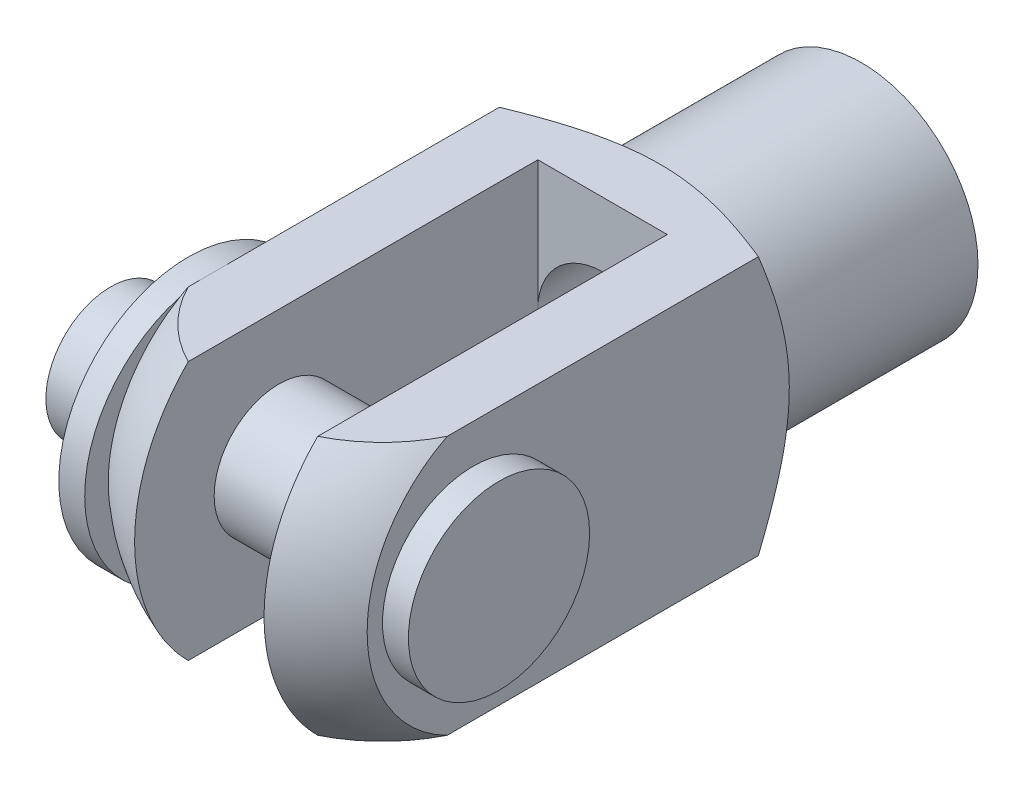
ISO-10303-21;
HEADER;
FILE_DESCRIPTION(('STEP AP214'),'2;1');
FILE_NAME('part.step','',(''),(''),'','','');
FILE_SCHEMA(('AUTOMOTIVE_DESIGN { 1 0 10303 214 1 1 1 1 }'));
ENDSEC;
DATA;
#1=APPLICATION_CONTEXT('core data for automotive mechanical design processes');
#2=APPLICATION_PROTOCOL_DEFINITION('international standard','automotive_design',2000,#1);
#3=PRODUCT_CONTEXT('',#1,'mechanical');
#4=PRODUCT('Part','Part','',(#3));
#5=PRODUCT_RELATED_PRODUCT_CATEGORY('part','',(#4));
#6=PRODUCT_DEFINITION_FORMATION('','',#4);
#7=PRODUCT_DEFINITION_CONTEXT('part definition',#1,'design');
#8=PRODUCT_DEFINITION('design','',#6,#7);
#9=PRODUCT_DEFINITION_SHAPE('','',#8);
#10=(LENGTH_UNIT() NAMED_UNIT(*) SI_UNIT(.MILLI.,.METRE.));
#11=(NAMED_UNIT(*) PLANE_ANGLE_UNIT() SI_UNIT($,.RADIAN.));
#12=(NAMED_UNIT(*) SI_UNIT($,.STERADIAN.) SOLID_ANGLE_UNIT());
#13=UNCERTAINTY_MEASURE_WITH_UNIT(LENGTH_MEASURE(1.E-05),#10,'distance_accuracy_value','');
#14=(GEOMETRIC_REPRESENTATION_CONTEXT(3) GLOBAL_UNCERTAINTY_ASSIGNED_CONTEXT((#13)) GLOBAL_UNIT_ASSIGNED_CONTEXT((#10,
#11,#12)) REPRESENTATION_CONTEXT('',''));
#15=CARTESIAN_POINT('',(0.,0.,0.));
#16=DIRECTION('',(0.,0.,1.));
#17=DIRECTION('',(1.,0.,0.));
#18=AXIS2_PLACEMENT_3D('',#15,#16,#17);
#19=CARTESIAN_POINT('',(-10.,-19.,53.));
#20=DIRECTION('',(1.,0.,0.));
#21=DIRECTION('',(0.,0.,-1.));
#22=AXIS2_PLACEMENT_3D('',#19,#20,#21);
#23=PLANE('',#22);
#24=DIRECTION('',(0.,0.,1.));
#25=VECTOR('',#24,1.);
#26=CARTESIAN_POINT('',(-10.,10.,53.));
#27=LINE('',#26,#25);
#28=CARTESIAN_POINT('',(-10.,10.,40.));
#29=VERTEX_POINT('',#28);
#30=CARTESIAN_POINT('',(-10.,10.,42.));
#31=VERTEX_POINT('',#30);
#32=EDGE_CURVE('E132',#29,#31,#27,.T.);
#33=ORIENTED_EDGE('',*,*,#32,.F.);
#34=CARTESIAN_POINT('',(-10.,0.,40.));
#35=DIRECTION('',(1.,0.,0.));
#36=DIRECTION('',(0.,0.,-1.));
#37=AXIS2_PLACEMENT_3D('',#34,#35,#36);
#38=CIRCLE('',#37,10.);
#39=CARTESIAN_POINT('',(-10.,9.637888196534,42.6666666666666));
#40=VERTEX_POINT('',#39);
#41=EDGE_CURVE('E46',#29,#40,#38,.T.);
#42=ORIENTED_EDGE('',*,*,#41,.T.);
#43=CARTESIAN_POINT('',(-10.,-7.25114412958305E-13,36.9999999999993));
#44=DIRECTION('',(1.,0.,0.));
#45=DIRECTION('',(0.,0.,-1.));
#46=AXIS2_PLACEMENT_3D('',#43,#44,#45);
#47=CIRCLE('',#46,11.1803398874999);
#48=EDGE_CURVE('E123',#40,#31,#47,.F.);
#49=ORIENTED_EDGE('',*,*,#48,.T.);
#50=EDGE_LOOP('',(#33,#42,#49));
#51=FACE_BOUND('',#50,.T.);
#52=ADVANCED_FACE('F31',(#51),#23,.F.);
#53=CARTESIAN_POINT('',(-10.,-10.,42.0000000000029));
#54=VERTEX_POINT('',#53);
#55=CARTESIAN_POINT('',(-10.,-9.63788819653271,42.6666666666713));
#56=VERTEX_POINT('',#55);
#57=EDGE_CURVE('E122',#54,#56,#47,.F.);
#58=ORIENTED_EDGE('',*,*,#57,.T.);
#59=CARTESIAN_POINT('',(-10.,0.,40.));
#60=DIRECTION('',(1.,0.,0.));
#61=DIRECTION('',(0.,0.,-1.));
#62=AXIS2_PLACEMENT_3D('',#59,#60,#61);
#63=CIRCLE('',#62,10.);
#64=CARTESIAN_POINT('',(-10.,-10.,40.));
#65=VERTEX_POINT('',#64);
#66=EDGE_CURVE('E11',#56,#65,#63,.T.);
#67=ORIENTED_EDGE('',*,*,#66,.T.);
#68=DIRECTION('',(0.,0.,-1.));
#69=VECTOR('',#68,1.);
#70=CARTESIAN_POINT('',(-10.,-10.,15.));
#71=LINE('',#70,#69);
#72=EDGE_CURVE('E147',#54,#65,#71,.T.);
#73=ORIENTED_EDGE('',*,*,#72,.F.);
#74=EDGE_LOOP('',(#58,#67,#73));
#75=FACE_BOUND('',#74,.T.);
#76=ADVANCED_FACE('F199',(#75),#23,.F.);
#77=CARTESIAN_POINT('',(5.,-16.,20.));
#78=DIRECTION('',(0.,0.,-1.));
#79=DIRECTION('',(-1.,0.,0.));
#80=AXIS2_PLACEMENT_3D('',#77,#78,#79);
#81=PLANE('',#80);
#82=DIRECTION('',(0.,1.,0.));
#83=VECTOR('',#82,1.);
#84=CARTESIAN_POINT('',(-5.,-16.,20.));
#85=LINE('',#84,#83);
#86=CARTESIAN_POINT('',(-5.,0.,20.));
#87=VERTEX_POINT('',#86);
#88=CARTESIAN_POINT('',(-5.,10.,20.));
#89=VERTEX_POINT('',#88);
#90=EDGE_CURVE('E271',#87,#89,#85,.T.);
#91=ORIENTED_EDGE('',*,*,#90,.F.);
#92=CARTESIAN_POINT('',(0.,0.,20.));
#93=DIRECTION('',(0.,0.,-1.));
#94=DIRECTION('',(-1.,0.,0.));
#95=AXIS2_PLACEMENT_3D('',#92,#93,#94);
#96=CIRCLE('',#95,5.);
#97=CARTESIAN_POINT('',(5.,0.,20.));
#98=VERTEX_POINT('',#97);
#99=EDGE_CURVE('E53',#87,#98,#96,.T.);
#100=ORIENTED_EDGE('',*,*,#99,.T.);
#101=DIRECTION('',(0.,1.,0.));
#102=VECTOR('',#101,1.);
#103=CARTESIAN_POINT('',(5.,-16.,20.));
#104=LINE('',#103,#102);
#105=CARTESIAN_POINT('',(5.,10.,20.));
#106=VERTEX_POINT('',#105);
#107=EDGE_CURVE('E266',#98,#106,#104,.T.);
#108=ORIENTED_EDGE('',*,*,#107,.T.);
#109=DIRECTION('',(1.,0.,0.));
#110=VECTOR('',#109,1.);
#111=CARTESIAN_POINT('',(-19.,10.,20.));
#112=LINE('',#111,#110);
#113=EDGE_CURVE('E242',#89,#106,#112,.T.);
#114=ORIENTED_EDGE('',*,*,#113,.F.);
#115=EDGE_LOOP('',(#91,#100,#108,#114));
#116=FACE_BOUND('',#115,.T.);
#117=ADVANCED_FACE('F205',(#116),#81,.F.);
#118=CARTESIAN_POINT('',(0.,-7.25114412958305E-13,36.9999999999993));
#119=DIRECTION('',(0.,0.,-1.));
#120=DIRECTION('',(0.,1.,0.));
#121=AXIS2_PLACEMENT_3D('',#118,#119,#120);
#122=SPHERICAL_SURFACE('',#121,15.0000000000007);
#123=CARTESIAN_POINT('',(-5.,-7.25114412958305E-13,36.9999999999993));
#124=DIRECTION('',(-1.,0.,0.));
#125=DIRECTION('',(0.,0.,1.));
#126=AXIS2_PLACEMENT_3D('',#123,#124,#125);
#127=CIRCLE('',#126,14.1421356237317);
#128=CARTESIAN_POINT('',(-5.,10.,46.9999999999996));
#129=VERTEX_POINT('',#128);
#130=CARTESIAN_POINT('',(-5.,-10.,47.0000000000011));
#131=VERTEX_POINT('',#130);
#132=EDGE_CURVE('E224',#129,#131,#127,.F.);
#133=ORIENTED_EDGE('',*,*,#132,.F.);
#134=CARTESIAN_POINT('',(0.,10.,36.9999999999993));
#135=DIRECTION('',(0.,-1.,0.));
#136=DIRECTION('',(0.,0.,-1.));
#137=AXIS2_PLACEMENT_3D('',#134,#135,#136);
#138=CIRCLE('',#137,11.1803398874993);
#139=EDGE_CURVE('E138',#31,#129,#138,.F.);
#140=ORIENTED_EDGE('',*,*,#139,.F.);
#141=ORIENTED_EDGE('',*,*,#48,.F.);
#142=EDGE_CURVE('E115',#56,#40,#47,.F.);
#143=ORIENTED_EDGE('',*,*,#142,.F.);
#144=ORIENTED_EDGE('',*,*,#57,.F.);
#145=CARTESIAN_POINT('',(0.,-10.,36.9999999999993));
#146=DIRECTION('',(0.,1.,0.));
#147=DIRECTION('',(0.,0.,1.));
#148=AXIS2_PLACEMENT_3D('',#145,#146,#147);
#149=CIRCLE('',#148,11.1803398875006);
#150=EDGE_CURVE('E152',#131,#54,#149,.F.);
#151=ORIENTED_EDGE('',*,*,#150,.F.);
#152=EDGE_LOOP('',(#133,#140,#141,#143,#144,#151));
#153=FACE_BOUND('',#152,.T.);
#154=ADVANCED_FACE('F136',(#153),#122,.T.);
#155=CARTESIAN_POINT('',(5.,-7.25114412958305E-13,36.9999999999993));
#156=DIRECTION('',(1.,0.,0.));
#157=DIRECTION('',(0.,0.,-1.));
#158=AXIS2_PLACEMENT_3D('',#155,#156,#157);
#159=CIRCLE('',#158,14.1421356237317);
#160=CARTESIAN_POINT('',(5.,-10.,47.0000000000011));
#161=VERTEX_POINT('',#160);
#162=CARTESIAN_POINT('',(5.,10.,46.9999999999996));
#163=VERTEX_POINT('',#162);
#164=EDGE_CURVE('E270',#161,#163,#159,.F.);
#165=ORIENTED_EDGE('',*,*,#164,.F.);
#166=CARTESIAN_POINT('',(10.,-10.,42.0000000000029));
#167=VERTEX_POINT('',#166);
#168=EDGE_CURVE('E154',#167,#161,#149,.F.);
#169=ORIENTED_EDGE('',*,*,#168,.F.);
#170=CARTESIAN_POINT('',(10.,-7.25114412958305E-13,36.9999999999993));
#171=DIRECTION('',(-1.,0.,0.));
#172=DIRECTION('',(0.,0.,1.));
#173=AXIS2_PLACEMENT_3D('',#170,#171,#172);
#174=CIRCLE('',#173,11.1803398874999);
#175=CARTESIAN_POINT('',(10.,10.,42.));
#176=VERTEX_POINT('',#175);
#177=EDGE_CURVE('E286',#176,#167,#174,.F.);
#178=ORIENTED_EDGE('',*,*,#177,.F.);
#179=EDGE_CURVE('E157',#163,#176,#138,.F.);
#180=ORIENTED_EDGE('',*,*,#179,.F.);
#181=EDGE_LOOP('',(#165,#169,#178,#180));
#182=FACE_BOUND('',#181,.T.);
#183=ADVANCED_FACE('F33',(#182),#122,.T.);
#184=CARTESIAN_POINT('',(0.,0.,15.));
#185=DIRECTION('',(0.,0.,1.));
#186=DIRECTION('',(1.,0.,0.));
#187=AXIS2_PLACEMENT_3D('',#184,#185,#186);
#188=CONICAL_SURFACE('',#187,9.,1.04719755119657);
#189=CARTESIAN_POINT('',(-10.,-19.6172941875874,22.5165476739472));
#190=CARTESIAN_POINT('',(-10.,-19.1345220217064,22.268261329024));
#191=CARTESIAN_POINT('',(-10.,-18.6510060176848,22.0214067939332));
#192=CARTESIAN_POINT('',(-10.,-17.6820999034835,21.5313267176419));
#193=CARTESIAN_POINT('',(-10.,-17.1967096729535,21.2881014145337));
#194=CARTESIAN_POINT('',(-10.,-16.2225601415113,20.805497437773));
#195=CARTESIAN_POINT('',(-10.,-15.7337955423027,20.5661294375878));
#196=CARTESIAN_POINT('',(-10.,-14.7535976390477,20.0929405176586));
#197=CARTESIAN_POINT('',(-10.,-14.2621643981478,19.8591194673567));
#198=CARTESIAN_POINT('',(-10.,-13.2488743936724,19.3857597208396));
#199=CARTESIAN_POINT('',(-10.,-12.7268327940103,19.1466154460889));
#200=CARTESIAN_POINT('',(-10.,-11.678212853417,18.6783448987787));
#201=CARTESIAN_POINT('',(-10.,-11.1516342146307,18.4492192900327));
#202=CARTESIAN_POINT('',(-10.,-10.0933782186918,18.0043512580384));
#203=CARTESIAN_POINT('',(-10.,-9.5617058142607,17.7885971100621));
#204=CARTESIAN_POINT('',(-10.,-8.49159653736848,17.3746085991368));
#205=CARTESIAN_POINT('',(-10.,-7.9531607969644,17.1763713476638));
#206=CARTESIAN_POINT('',(-10.,-7.14240294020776,16.8976874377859));
#207=CARTESIAN_POINT('',(-10.,-6.87313878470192,16.8083508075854));
#208=CARTESIAN_POINT('',(-10.,-6.33249814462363,16.6363580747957));
#209=CARTESIAN_POINT('',(-10.,-6.06112167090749,16.5537019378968));
#210=CARTESIAN_POINT('',(-10.,-5.24356535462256,16.3172288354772));
#211=CARTESIAN_POINT('',(-10.,-4.69392432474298,16.1748951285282));
#212=CARTESIAN_POINT('',(-10.,-3.86816909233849,15.9925407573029));
#213=CARTESIAN_POINT('',(-10.,-3.5953685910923,15.9373391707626));
#214=CARTESIAN_POINT('',(-10.,-3.04782224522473,15.8376890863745));
#215=CARTESIAN_POINT('',(-10.,-2.77307664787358,15.7932392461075));
#216=CARTESIAN_POINT('',(-10.,-2.22194036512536,15.7161391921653));
#217=CARTESIAN_POINT('',(-10.,-1.94554978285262,15.6834882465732));
#218=CARTESIAN_POINT('',(-10.,-1.39158714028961,15.6308500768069));
#219=CARTESIAN_POINT('',(-10.,-1.11401520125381,15.6108615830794));
#220=CARTESIAN_POINT('',(-10.,-0.502305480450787,15.581441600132));
#221=CARTESIAN_POINT('',(-10.,-0.168021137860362,15.5749426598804));
#222=CARTESIAN_POINT('',(-10.,0.500365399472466,15.5813520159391));
#223=CARTESIAN_POINT('',(-10.,0.834467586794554,15.5942610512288));
#224=CARTESIAN_POINT('',(-10.,1.5014707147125,15.6389320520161));
#225=CARTESIAN_POINT('',(-10.,1.83437136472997,15.6706983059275));
#226=CARTESIAN_POINT('',(-10.,2.49800601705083,15.7518109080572));
#227=CARTESIAN_POINT('',(-10.,2.82873996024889,15.8011577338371));
#228=CARTESIAN_POINT('',(-10.,3.49636312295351,15.9172331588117));
#229=CARTESIAN_POINT('',(-10.,3.83317595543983,15.9843969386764));
#230=CARTESIAN_POINT('',(-10.,4.50353771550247,16.1333048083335));
#231=CARTESIAN_POINT('',(-10.,4.8370865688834,16.2150492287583));
#232=CARTESIAN_POINT('',(-10.,5.50098268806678,16.3910519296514));
#233=CARTESIAN_POINT('',(-10.,5.83132868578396,16.4853149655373));
#234=CARTESIAN_POINT('',(-10.,6.32441330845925,16.6346269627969));
#235=CARTESIAN_POINT('',(-10.,6.48836666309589,16.6857163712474));
#236=CARTESIAN_POINT('',(-10.,6.81549790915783,16.7903217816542));
#237=CARTESIAN_POINT('',(-10.,6.97867580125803,16.843837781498));
#238=CARTESIAN_POINT('',(-10.,7.44925248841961,17.0017312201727));
#239=CARTESIAN_POINT('',(-10.,7.75569413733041,17.108966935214));
#240=CARTESIAN_POINT('',(-10.,8.36615100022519,17.3301575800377));
#241=CARTESIAN_POINT('',(-10.,8.67016606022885,17.4441129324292));
#242=CARTESIAN_POINT('',(-10.,9.2760644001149,17.6777390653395));
#243=CARTESIAN_POINT('',(-10.,9.57794719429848,17.7974111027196));
#244=CARTESIAN_POINT('',(-10.,10.1797511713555,18.0415978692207));
#245=CARTESIAN_POINT('',(-10.,10.4796723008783,18.1661127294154));
#246=CARTESIAN_POINT('',(-10.,11.3773864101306,18.5460548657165));
#247=CARTESIAN_POINT('',(-10.,11.9725661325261,18.8076590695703));
#248=CARTESIAN_POINT('',(-10.,13.1573669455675,19.3429011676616));
#249=CARTESIAN_POINT('',(-10.,13.7469886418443,19.6165377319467));
#250=CARTESIAN_POINT('',(-10.,14.9239282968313,20.1738354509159));
#251=CARTESIAN_POINT('',(-10.,15.5112315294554,20.4575276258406));
#252=CARTESIAN_POINT('',(-10.,16.6824162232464,21.0319023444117));
#253=CARTESIAN_POINT('',(-10.,17.2662976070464,21.3225850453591));
#254=CARTESIAN_POINT('',(-10.,18.4309932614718,21.909226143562));
#255=CARTESIAN_POINT('',(-10.,19.0118090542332,22.2051815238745));
#256=CARTESIAN_POINT('',(-10.,20.1712182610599,22.801395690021));
#257=CARTESIAN_POINT('',(-10.,20.7498116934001,23.1016544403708));
#258=CARTESIAN_POINT('',(-10.,22.3274156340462,23.9263172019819));
#259=CARTESIAN_POINT('',(-10.,23.3246309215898,24.4541539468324));
#260=CARTESIAN_POINT('',(-10.,25.3153401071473,25.5171531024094));
#261=CARTESIAN_POINT('',(-10.,26.3088333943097,26.052316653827));
#262=CARTESIAN_POINT('',(-10.,28.2861079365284,27.1242510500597));
#263=CARTESIAN_POINT('',(-10.,29.269908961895,27.6609854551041));
#264=CARTESIAN_POINT('',(-10.,30.7438970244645,28.4689987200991));
#265=CARTESIAN_POINT('',(-10.,31.2348967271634,28.7387973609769));
#266=CARTESIAN_POINT('',(-10.,32.2164156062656,29.2792654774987));
#267=CARTESIAN_POINT('',(-10.,32.7069347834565,29.5499349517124));
#268=CARTESIAN_POINT('',(-10.,33.1972449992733,29.8209825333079));
#269=B_SPLINE_CURVE_WITH_KNOTS('',3,(#189,#190,#191,#192,#193,#194,#195,#196,#197,#198,#199,
#200,#201,#202,#203,#204,#205,#206,#207,#208,#209,#210,#211,#212,#213,#214,#215,#216,#217,#218,
#219,#220,#221,#222,#223,#224,#225,#226,#227,#228,#229,#230,#231,#232,#233,#234,#235,#236,#237,
#238,#239,#240,#241,#242,#243,#244,#245,#246,#247,#248,#249,#250,#251,#252,#253,#254,#255,#256,
#257,#258,#259,#260,#261,#262,#263,#264,#265,#266,#267,#268),.UNSPECIFIED.,.F.,.F.,(4,2,2,2,2,2,
2,2,2,2,2,2,2,2,2,2,2,2,2,2,2,2,2,2,2,2,2,2,2,2,2,2,2,2,2,2,2,2,2,4),(0.,1.62863751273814,
3.25738140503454,4.89004745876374,6.52267504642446,8.24522626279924,9.96789143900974,
11.6890240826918,13.4098723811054,14.2608827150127,15.1118886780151,16.8137916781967,
17.6486097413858,18.4833235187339,19.3179855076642,20.1525637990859,21.1550285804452,
22.157531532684,23.1602625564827,24.1630208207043,25.1929794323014,26.222961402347,
27.2533357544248,27.7685073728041,28.2836785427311,29.2575652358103,30.2315132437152,
31.2056763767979,32.1798658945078,34.130061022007,36.0800411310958,38.0366750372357,
39.9933530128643,41.9489452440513,43.9045213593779,47.2893585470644,50.6747288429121,
54.0367889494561,55.7175167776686,57.3982418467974),.UNSPECIFIED.);
#270=CARTESIAN_POINT('',(-10.,10.,17.9688133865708));
#271=VERTEX_POINT('',#270);
#272=CARTESIAN_POINT('',(-10.,-10.,17.9688133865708));
#273=VERTEX_POINT('',#272);
#274=EDGE_CURVE('E139',#271,#273,#269,.F.);
#275=ORIENTED_EDGE('',*,*,#274,.F.);
#276=CARTESIAN_POINT('',(-22.1168264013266,10.,23.8175790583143));
#277=CARTESIAN_POINT('',(-21.6006514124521,10.,23.5460652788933));
#278=CARTESIAN_POINT('',(-21.0838339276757,10.,23.2757635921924));
#279=CARTESIAN_POINT('',(-20.0485865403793,10.,22.738218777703));
#280=CARTESIAN_POINT('',(-19.5301565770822,10.,22.4709757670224));
#281=CARTESIAN_POINT('',(-18.4907952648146,10.,21.9398964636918));
#282=CARTESIAN_POINT('',(-17.9698617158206,10.,21.6760644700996));
#283=CARTESIAN_POINT('',(-16.9256843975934,10.,21.15302267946));
#284=CARTESIAN_POINT('',(-16.4024406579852,10.,20.8938128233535));
#285=CARTESIAN_POINT('',(-15.3167623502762,10.,20.3634200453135));
#286=CARTESIAN_POINT('',(-14.7541245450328,10.,20.092652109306));
#287=CARTESIAN_POINT('',(-13.6247695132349,10.,19.5596734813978));
#288=CARTESIAN_POINT('',(-13.0580521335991,10.,19.2974631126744));
#289=CARTESIAN_POINT('',(-11.9196257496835,10.,18.7843977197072));
#290=CARTESIAN_POINT('',(-11.3479178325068,10.,18.5335402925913));
#291=CARTESIAN_POINT('',(-10.1980816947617,10.,18.0469772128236));
#292=CARTESIAN_POINT('',(-9.61995399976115,10.,17.8112703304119));
#293=CARTESIAN_POINT('',(-8.65746605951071,10.,17.4386892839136));
#294=CARTESIAN_POINT('',(-8.27540892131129,10.,17.2958791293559));
#295=CARTESIAN_POINT('',(-7.50739675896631,10.,17.0211889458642));
#296=CARTESIAN_POINT('',(-7.12144206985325,10.,16.8893079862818));
#297=CARTESIAN_POINT('',(-6.34510405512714,10.,16.6389698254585));
#298=CARTESIAN_POINT('',(-5.95472004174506,10.,16.5205147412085));
#299=CARTESIAN_POINT('',(-5.16927956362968,10.,16.3000953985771));
#300=CARTESIAN_POINT('',(-4.77422314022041,10.,16.1981309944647));
#301=CARTESIAN_POINT('',(-3.99041100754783,10.,16.0166878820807));
#302=CARTESIAN_POINT('',(-3.60178245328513,10.,15.9366661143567));
#303=CARTESIAN_POINT('',(-2.82057534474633,10.,15.7987751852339));
#304=CARTESIAN_POINT('',(-2.42799698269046,10.,15.7409049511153));
#305=CARTESIAN_POINT('',(-1.64039133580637,10.,15.6502784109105));
#306=CARTESIAN_POINT('',(-1.24536763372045,10.,15.6174914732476));
#307=CARTESIAN_POINT('',(-0.454002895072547,10.,15.5788167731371));
#308=CARTESIAN_POINT('',(-0.0576619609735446,10.,15.5729269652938));
#309=CARTESIAN_POINT('',(0.685516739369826,10.,15.587428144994));
#310=CARTESIAN_POINT('',(1.03242082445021,10.,15.6046621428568));
#311=CARTESIAN_POINT('',(1.72462432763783,10.,15.6592373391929));
#312=CARTESIAN_POINT('',(2.06992376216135,10.,15.6965783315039));
#313=CARTESIAN_POINT('',(2.75827177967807,10.,15.7898298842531));
#314=CARTESIAN_POINT('',(3.10131819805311,10.,15.8457562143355));
#315=CARTESIAN_POINT('',(3.7842882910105,10.,15.9741128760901));
#316=CARTESIAN_POINT('',(4.12421184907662,10.,16.0465438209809));
#317=CARTESIAN_POINT('',(4.81174019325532,10.,16.2083003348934));
#318=CARTESIAN_POINT('',(5.15923217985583,10.,16.2981013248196));
#319=CARTESIAN_POINT('',(5.85059904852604,10.,16.4905951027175));
#320=CARTESIAN_POINT('',(6.1944739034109,10.,16.5932879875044));
#321=CARTESIAN_POINT('',(6.87875181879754,10.,16.8094452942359));
#322=CARTESIAN_POINT('',(7.21915535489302,10.,16.9229082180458));
#323=CARTESIAN_POINT('',(7.72738846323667,10.,17.0998350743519));
#324=CARTESIAN_POINT('',(7.89640188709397,10.,17.1599319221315));
#325=CARTESIAN_POINT('',(8.23368426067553,10.,17.2821790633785));
#326=CARTESIAN_POINT('',(8.40195321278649,10.,17.3443293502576));
#327=CARTESIAN_POINT('',(8.91909703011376,10.,17.5386154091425));
#328=CARTESIAN_POINT('',(9.26680587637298,10.,17.6738604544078));
#329=CARTESIAN_POINT('',(9.95955322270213,10.,17.9510429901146));
#330=CARTESIAN_POINT('',(10.3045915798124,10.,18.0929808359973));
#331=CARTESIAN_POINT('',(10.9923846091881,10.,18.3824467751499));
#332=CARTESIAN_POINT('',(11.3351388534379,10.,18.5299758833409));
#333=CARTESIAN_POINT('',(12.0186088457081,10.,18.8296912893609));
#334=CARTESIAN_POINT('',(12.3593245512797,10.,18.9818776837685));
#335=CARTESIAN_POINT('',(13.0392290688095,10.,19.2902803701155));
#336=CARTESIAN_POINT('',(13.3784165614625,10.,19.4464995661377));
#337=CARTESIAN_POINT('',(14.0552415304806,10.,19.7622635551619));
#338=CARTESIAN_POINT('',(14.3928789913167,10.,19.9218083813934));
#339=CARTESIAN_POINT('',(15.4036964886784,10.,20.4046350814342));
#340=CARTESIAN_POINT('',(16.0748578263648,10.,20.7321440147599));
#341=CARTESIAN_POINT('',(17.414816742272,10.,21.3963437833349));
#342=CARTESIAN_POINT('',(18.0836033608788,10.,21.7330566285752));
#343=CARTESIAN_POINT('',(19.4179596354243,10.,22.4128212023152));
#344=CARTESIAN_POINT('',(20.0835292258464,10.,22.7558730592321));
#345=CARTESIAN_POINT('',(21.4118308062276,10.,23.4467144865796));
#346=CARTESIAN_POINT('',(22.0745639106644,10.,23.794501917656));
#347=CARTESIAN_POINT('',(23.3979885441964,10.,24.4939244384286));
#348=CARTESIAN_POINT('',(24.0586800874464,10.,24.8455595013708));
#349=CARTESIAN_POINT('',(25.8326112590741,10.,25.7949747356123));
#350=CARTESIAN_POINT('',(26.9443340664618,10.,26.3955878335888));
#351=CARTESIAN_POINT('',(29.1645673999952,10.,27.6030403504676));
#352=CARTESIAN_POINT('',(30.2730775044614,10.,28.2098805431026));
#353=CARTESIAN_POINT('',(32.4821181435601,10.,29.4250617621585));
#354=CARTESIAN_POINT('',(33.582660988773,10.,30.0333804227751));
#355=CARTESIAN_POINT('',(35.2319904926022,10.,30.9483513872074));
#356=CARTESIAN_POINT('',(35.7814813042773,10.,31.2537358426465));
#357=CARTESIAN_POINT('',(36.8800465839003,10.,31.8652514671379));
#358=CARTESIAN_POINT('',(37.4291210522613,10.,32.1713826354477));
#359=CARTESIAN_POINT('',(37.9780143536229,10.,32.4778383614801));
#360=B_SPLINE_CURVE_WITH_KNOTS('',3,(#276,#277,#278,#279,#280,#281,#282,#283,#284,#285,#286,
#287,#288,#289,#290,#291,#292,#293,#294,#295,#296,#297,#298,#299,#300,#301,#302,#303,#304,#305,
#306,#307,#308,#309,#310,#311,#312,#313,#314,#315,#316,#317,#318,#319,#320,#321,#322,#323,#324,
#325,#326,#327,#328,#329,#330,#331,#332,#333,#334,#335,#336,#337,#338,#339,#340,#341,#342,#343,
#344,#345,#346,#347,#348,#349,#350,#351,#352,#353,#354,#355,#356,#357,#358,#359),.UNSPECIFIED.,
.F.,.F.,(4,2,2,2,2,2,2,2,2,2,2,2,2,2,2,2,2,2,2,2,2,2,2,2,2,2,2,2,2,2,2,2,2,2,2,2,2,2,2,2,2,4),
(0.,1.74969261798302,3.49945200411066,5.2512357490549,7.00299709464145,8.87614574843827,
10.7493650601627,12.6221860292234,14.4948547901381,15.7183523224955,16.9417455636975,
18.1653314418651,19.3889065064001,20.5787017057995,21.7684392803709,22.9567216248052,
24.1449136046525,25.1863091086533,26.227693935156,27.269964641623,28.3122740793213,
29.3887027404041,30.4651394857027,31.5414267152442,32.0795559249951,32.6176834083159,
33.7368458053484,34.8560677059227,35.9754937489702,37.0949430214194,38.2152222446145,
39.3355126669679,41.5758422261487,43.8221020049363,46.0684073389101,48.3137294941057,
50.5590360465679,54.3497797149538,58.1410002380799,61.9134201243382,63.7993673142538,
65.6853126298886),.UNSPECIFIED.);
#361=CARTESIAN_POINT('',(10.0000000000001,10.,17.9688133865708));
#362=VERTEX_POINT('',#361);
#363=EDGE_CURVE('E171',#362,#271,#360,.F.);
#364=ORIENTED_EDGE('',*,*,#363,.F.);
#365=CARTESIAN_POINT('',(10.,-19.6172941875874,22.5165476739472));
#366=CARTESIAN_POINT('',(10.,-19.1345220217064,22.268261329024));
#367=CARTESIAN_POINT('',(10.,-18.6510060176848,22.0214067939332));
#368=CARTESIAN_POINT('',(10.,-17.6820999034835,21.5313267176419));
#369=CARTESIAN_POINT('',(10.,-17.1967096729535,21.2881014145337));
#370=CARTESIAN_POINT('',(10.,-16.2225601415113,20.805497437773));
#371=CARTESIAN_POINT('',(10.,-15.7337955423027,20.5661294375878));
#372=CARTESIAN_POINT('',(10.,-14.7535976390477,20.0929405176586));
#373=CARTESIAN_POINT('',(10.,-14.2621643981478,19.8591194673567));
#374=CARTESIAN_POINT('',(10.,-13.2488743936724,19.3857597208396));
#375=CARTESIAN_POINT('',(10.,-12.7268327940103,19.1466154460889));
#376=CARTESIAN_POINT('',(10.,-11.678212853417,18.6783448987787));
#377=CARTESIAN_POINT('',(10.,-11.1516342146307,18.4492192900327));
#378=CARTESIAN_POINT('',(10.,-10.0933782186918,18.0043512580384));
#379=CARTESIAN_POINT('',(10.,-9.5617058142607,17.7885971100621));
#380=CARTESIAN_POINT('',(10.,-8.49159653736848,17.3746085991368));
#381=CARTESIAN_POINT('',(10.,-7.9531607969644,17.1763713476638));
#382=CARTESIAN_POINT('',(10.,-7.14240294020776,16.8976874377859));
#383=CARTESIAN_POINT('',(10.,-6.87313878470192,16.8083508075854));
#384=CARTESIAN_POINT('',(10.,-6.33249814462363,16.6363580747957));
#385=CARTESIAN_POINT('',(10.,-6.06112167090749,16.5537019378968));
#386=CARTESIAN_POINT('',(10.,-5.24356535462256,16.3172288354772));
#387=CARTESIAN_POINT('',(10.,-4.69392432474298,16.1748951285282));
#388=CARTESIAN_POINT('',(10.,-3.86816909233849,15.9925407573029));
#389=CARTESIAN_POINT('',(10.,-3.5953685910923,15.9373391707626));
#390=CARTESIAN_POINT('',(10.,-3.04782224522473,15.8376890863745));
#391=CARTESIAN_POINT('',(10.,-2.77307664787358,15.7932392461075));
#392=CARTESIAN_POINT('',(10.,-2.22194036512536,15.7161391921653));
#393=CARTESIAN_POINT('',(10.,-1.94554978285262,15.6834882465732));
#394=CARTESIAN_POINT('',(10.,-1.39158714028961,15.6308500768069));
#395=CARTESIAN_POINT('',(10.,-1.11401520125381,15.6108615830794));
#396=CARTESIAN_POINT('',(10.,-0.502305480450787,15.581441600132));
#397=CARTESIAN_POINT('',(10.,-0.168021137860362,15.5749426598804));
#398=CARTESIAN_POINT('',(10.,0.500365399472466,15.5813520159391));
#399=CARTESIAN_POINT('',(10.,0.834467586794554,15.5942610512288));
#400=CARTESIAN_POINT('',(10.,1.5014707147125,15.6389320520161));
#401=CARTESIAN_POINT('',(10.,1.83437136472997,15.6706983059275));
#402=CARTESIAN_POINT('',(10.,2.49800601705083,15.7518109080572));
#403=CARTESIAN_POINT('',(10.,2.82873996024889,15.8011577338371));
#404=CARTESIAN_POINT('',(10.,3.49636312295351,15.9172331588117));
#405=CARTESIAN_POINT('',(10.,3.83317595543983,15.9843969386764));
#406=CARTESIAN_POINT('',(10.,4.50353771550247,16.1333048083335));
#407=CARTESIAN_POINT('',(10.,4.8370865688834,16.2150492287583));
#408=CARTESIAN_POINT('',(10.,5.50098268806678,16.3910519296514));
#409=CARTESIAN_POINT('',(10.,5.83132868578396,16.4853149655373));
#410=CARTESIAN_POINT('',(10.,6.32441330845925,16.6346269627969));
#411=CARTESIAN_POINT('',(10.,6.48836666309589,16.6857163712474));
#412=CARTESIAN_POINT('',(10.,6.81549790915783,16.7903217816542));
#413=CARTESIAN_POINT('',(10.,6.97867580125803,16.843837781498));
#414=CARTESIAN_POINT('',(10.,7.44925248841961,17.0017312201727));
#415=CARTESIAN_POINT('',(10.,7.75569413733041,17.108966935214));
#416=CARTESIAN_POINT('',(10.,8.36615100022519,17.3301575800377));
#417=CARTESIAN_POINT('',(10.,8.67016606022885,17.4441129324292));
#418=CARTESIAN_POINT('',(10.,9.2760644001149,17.6777390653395));
#419=CARTESIAN_POINT('',(10.,9.57794719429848,17.7974111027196));
#420=CARTESIAN_POINT('',(10.,10.1797511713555,18.0415978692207));
#421=CARTESIAN_POINT('',(10.,10.4796723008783,18.1661127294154));
#422=CARTESIAN_POINT('',(10.,11.3773864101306,18.5460548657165));
#423=CARTESIAN_POINT('',(10.,11.9725661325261,18.8076590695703));
#424=CARTESIAN_POINT('',(10.,13.1573669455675,19.3429011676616));
#425=CARTESIAN_POINT('',(10.,13.7469886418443,19.6165377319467));
#426=CARTESIAN_POINT('',(10.,14.9239282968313,20.1738354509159));
#427=CARTESIAN_POINT('',(10.,15.5112315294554,20.4575276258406));
#428=CARTESIAN_POINT('',(10.,16.6824162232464,21.0319023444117));
#429=CARTESIAN_POINT('',(10.,17.2662976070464,21.3225850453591));
#430=CARTESIAN_POINT('',(10.,18.4309932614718,21.909226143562));
#431=CARTESIAN_POINT('',(10.,19.0118090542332,22.2051815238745));
#432=CARTESIAN_POINT('',(10.,20.1712182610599,22.801395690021));
#433=CARTESIAN_POINT('',(10.,20.7498116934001,23.1016544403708));
#434=CARTESIAN_POINT('',(10.,22.3274156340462,23.9263172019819));
#435=CARTESIAN_POINT('',(10.,23.3246309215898,24.4541539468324));
#436=CARTESIAN_POINT('',(10.,25.3153401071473,25.5171531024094));
#437=CARTESIAN_POINT('',(10.,26.3088333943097,26.052316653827));
#438=CARTESIAN_POINT('',(10.,28.2861079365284,27.1242510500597));
#439=CARTESIAN_POINT('',(10.,29.269908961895,27.6609854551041));
#440=CARTESIAN_POINT('',(10.,30.7438970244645,28.4689987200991));
#441=CARTESIAN_POINT('',(10.,31.2348967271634,28.7387973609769));
#442=CARTESIAN_POINT('',(10.,32.2164156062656,29.2792654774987));
#443=CARTESIAN_POINT('',(10.,32.7069347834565,29.5499349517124));
#444=CARTESIAN_POINT('',(10.,33.1972449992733,29.8209825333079));
#445=B_SPLINE_CURVE_WITH_KNOTS('',3,(#365,#366,#367,#368,#369,#370,#371,#372,#373,#374,#375,
#376,#377,#378,#379,#380,#381,#382,#383,#384,#385,#386,#387,#388,#389,#390,#391,#392,#393,#394,
#395,#396,#397,#398,#399,#400,#401,#402,#403,#404,#405,#406,#407,#408,#409,#410,#411,#412,#413,
#414,#415,#416,#417,#418,#419,#420,#421,#422,#423,#424,#425,#426,#427,#428,#429,#430,#431,#432,
#433,#434,#435,#436,#437,#438,#439,#440,#441,#442,#443,#444),.UNSPECIFIED.,.F.,.F.,(4,2,2,2,2,2,
2,2,2,2,2,2,2,2,2,2,2,2,2,2,2,2,2,2,2,2,2,2,2,2,2,2,2,2,2,2,2,2,2,4),(0.,1.62863751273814,
3.25738140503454,4.89004745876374,6.52267504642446,8.24522626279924,9.96789143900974,
11.6890240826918,13.4098723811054,14.2608827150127,15.1118886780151,16.8137916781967,
17.6486097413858,18.4833235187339,19.3179855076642,20.1525637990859,21.1550285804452,
22.157531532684,23.1602625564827,24.1630208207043,25.1929794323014,26.222961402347,
27.2533357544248,27.7685073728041,28.2836785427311,29.2575652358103,30.2315132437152,
31.2056763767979,32.1798658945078,34.130061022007,36.0800411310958,38.0366750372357,
39.9933530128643,41.9489452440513,43.9045213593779,47.2893585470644,50.6747288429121,
54.0367889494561,55.7175167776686,57.3982418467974),.UNSPECIFIED.);
#446=CARTESIAN_POINT('',(10.,-10.,17.9688133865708));
#447=VERTEX_POINT('',#446);
#448=EDGE_CURVE('E281',#447,#362,#445,.T.);
#449=ORIENTED_EDGE('',*,*,#448,.F.);
#450=CARTESIAN_POINT('',(-22.1168264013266,-10.,23.8175790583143));
#451=CARTESIAN_POINT('',(-21.6006514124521,-10.,23.5460652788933));
#452=CARTESIAN_POINT('',(-21.0838339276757,-10.,23.2757635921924));
#453=CARTESIAN_POINT('',(-20.0485865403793,-10.,22.738218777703));
#454=CARTESIAN_POINT('',(-19.5301565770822,-10.,22.4709757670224));
#455=CARTESIAN_POINT('',(-18.4907952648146,-10.,21.9398964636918));
#456=CARTESIAN_POINT('',(-17.9698617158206,-10.,21.6760644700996));
#457=CARTESIAN_POINT('',(-16.9256843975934,-10.,21.15302267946));
#458=CARTESIAN_POINT('',(-16.4024406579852,-10.,20.8938128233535));
#459=CARTESIAN_POINT('',(-15.3167623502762,-10.,20.3634200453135));
#460=CARTESIAN_POINT('',(-14.7541245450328,-10.,20.092652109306));
#461=CARTESIAN_POINT('',(-13.6247695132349,-10.,19.5596734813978));
#462=CARTESIAN_POINT('',(-13.0580521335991,-10.,19.2974631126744));
#463=CARTESIAN_POINT('',(-11.9196257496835,-10.,18.7843977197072));
#464=CARTESIAN_POINT('',(-11.3479178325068,-10.,18.5335402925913));
#465=CARTESIAN_POINT('',(-10.1980816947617,-10.,18.0469772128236));
#466=CARTESIAN_POINT('',(-9.61995399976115,-10.,17.8112703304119));
#467=CARTESIAN_POINT('',(-8.65746605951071,-10.,17.4386892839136));
#468=CARTESIAN_POINT('',(-8.27540892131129,-10.,17.2958791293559));
#469=CARTESIAN_POINT('',(-7.50739675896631,-10.,17.0211889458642));
#470=CARTESIAN_POINT('',(-7.12144206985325,-10.,16.8893079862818));
#471=CARTESIAN_POINT('',(-6.34510405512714,-10.,16.6389698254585));
#472=CARTESIAN_POINT('',(-5.95472004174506,-10.,16.5205147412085));
#473=CARTESIAN_POINT('',(-5.16927956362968,-10.,16.3000953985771));
#474=CARTESIAN_POINT('',(-4.77422314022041,-10.,16.1981309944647));
#475=CARTESIAN_POINT('',(-3.99041100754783,-10.,16.0166878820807));
#476=CARTESIAN_POINT('',(-3.60178245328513,-10.,15.9366661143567));
#477=CARTESIAN_POINT('',(-2.82057534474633,-10.,15.7987751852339));
#478=CARTESIAN_POINT('',(-2.42799698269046,-10.,15.7409049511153));
#479=CARTESIAN_POINT('',(-1.64039133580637,-10.,15.6502784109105));
#480=CARTESIAN_POINT('',(-1.24536763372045,-10.,15.6174914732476));
#481=CARTESIAN_POINT('',(-0.454002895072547,-10.,15.5788167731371));
#482=CARTESIAN_POINT('',(-0.0576619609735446,-10.,15.5729269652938));
#483=CARTESIAN_POINT('',(0.685516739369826,-10.,15.587428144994));
#484=CARTESIAN_POINT('',(1.03242082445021,-10.,15.6046621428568));
#485=CARTESIAN_POINT('',(1.72462432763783,-10.,15.6592373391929));
#486=CARTESIAN_POINT('',(2.06992376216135,-10.,15.6965783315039));
#487=CARTESIAN_POINT('',(2.75827177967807,-10.,15.7898298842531));
#488=CARTESIAN_POINT('',(3.10131819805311,-10.,15.8457562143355));
#489=CARTESIAN_POINT('',(3.7842882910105,-10.,15.9741128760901));
#490=CARTESIAN_POINT('',(4.12421184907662,-10.,16.0465438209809));
#491=CARTESIAN_POINT('',(4.81174019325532,-10.,16.2083003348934));
#492=CARTESIAN_POINT('',(5.15923217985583,-10.,16.2981013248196));
#493=CARTESIAN_POINT('',(5.85059904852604,-10.,16.4905951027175));
#494=CARTESIAN_POINT('',(6.1944739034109,-10.,16.5932879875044));
#495=CARTESIAN_POINT('',(6.87875181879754,-10.,16.8094452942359));
#496=CARTESIAN_POINT('',(7.21915535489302,-10.,16.9229082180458));
#497=CARTESIAN_POINT('',(7.72738846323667,-10.,17.0998350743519));
#498=CARTESIAN_POINT('',(7.89640188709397,-10.,17.1599319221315));
#499=CARTESIAN_POINT('',(8.23368426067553,-10.,17.2821790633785));
#500=CARTESIAN_POINT('',(8.40195321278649,-10.,17.3443293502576));
#501=CARTESIAN_POINT('',(8.91909703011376,-10.,17.5386154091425));
#502=CARTESIAN_POINT('',(9.26680587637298,-10.,17.6738604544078));
#503=CARTESIAN_POINT('',(9.95955322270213,-10.,17.9510429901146));
#504=CARTESIAN_POINT('',(10.3045915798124,-10.,18.0929808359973));
#505=CARTESIAN_POINT('',(10.9923846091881,-10.,18.3824467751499));
#506=CARTESIAN_POINT('',(11.3351388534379,-10.,18.5299758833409));
#507=CARTESIAN_POINT('',(12.0186088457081,-10.,18.8296912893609));
#508=CARTESIAN_POINT('',(12.3593245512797,-10.,18.9818776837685));
#509=CARTESIAN_POINT('',(13.0392290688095,-10.,19.2902803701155));
#510=CARTESIAN_POINT('',(13.3784165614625,-10.,19.4464995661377));
#511=CARTESIAN_POINT('',(14.0552415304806,-10.,19.7622635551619));
#512=CARTESIAN_POINT('',(14.3928789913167,-10.,19.9218083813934));
#513=CARTESIAN_POINT('',(15.4036964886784,-10.,20.4046350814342));
#514=CARTESIAN_POINT('',(16.0748578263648,-10.,20.7321440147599));
#515=CARTESIAN_POINT('',(17.414816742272,-10.,21.3963437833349));
#516=CARTESIAN_POINT('',(18.0836033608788,-10.,21.7330566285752));
#517=CARTESIAN_POINT('',(19.4179596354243,-10.,22.4128212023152));
#518=CARTESIAN_POINT('',(20.0835292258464,-10.,22.7558730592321));
#519=CARTESIAN_POINT('',(21.4118308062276,-10.,23.4467144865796));
#520=CARTESIAN_POINT('',(22.0745639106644,-10.,23.794501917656));
#521=CARTESIAN_POINT('',(23.3979885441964,-10.,24.4939244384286));
#522=CARTESIAN_POINT('',(24.0586800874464,-10.,24.8455595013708));
#523=CARTESIAN_POINT('',(25.8326112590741,-10.,25.7949747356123));
#524=CARTESIAN_POINT('',(26.9443340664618,-10.,26.3955878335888));
#525=CARTESIAN_POINT('',(29.1645673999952,-10.,27.6030403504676));
#526=CARTESIAN_POINT('',(30.2730775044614,-10.,28.2098805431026));
#527=CARTESIAN_POINT('',(32.4821181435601,-10.,29.4250617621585));
#528=CARTESIAN_POINT('',(33.582660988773,-10.,30.0333804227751));
#529=CARTESIAN_POINT('',(35.2319904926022,-10.,30.9483513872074));
#530=CARTESIAN_POINT('',(35.7814813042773,-10.,31.2537358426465));
#531=CARTESIAN_POINT('',(36.8800465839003,-10.,31.8652514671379));
#532=CARTESIAN_POINT('',(37.4291210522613,-10.,32.1713826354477));
#533=CARTESIAN_POINT('',(37.9780143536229,-10.,32.4778383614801));
#534=B_SPLINE_CURVE_WITH_KNOTS('',3,(#450,#451,#452,#453,#454,#455,#456,#457,#458,#459,#460,
#461,#462,#463,#464,#465,#466,#467,#468,#469,#470,#471,#472,#473,#474,#475,#476,#477,#478,#479,
#480,#481,#482,#483,#484,#485,#486,#487,#488,#489,#490,#491,#492,#493,#494,#495,#496,#497,#498,
#499,#500,#501,#502,#503,#504,#505,#506,#507,#508,#509,#510,#511,#512,#513,#514,#515,#516,#517,
#518,#519,#520,#521,#522,#523,#524,#525,#526,#527,#528,#529,#530,#531,#532,#533),.UNSPECIFIED.,
.F.,.F.,(4,2,2,2,2,2,2,2,2,2,2,2,2,2,2,2,2,2,2,2,2,2,2,2,2,2,2,2,2,2,2,2,2,2,2,2,2,2,2,2,2,4),
(0.,1.74969261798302,3.49945200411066,5.2512357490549,7.00299709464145,8.87614574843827,
10.7493650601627,12.6221860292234,14.4948547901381,15.7183523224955,16.9417455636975,
18.1653314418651,19.3889065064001,20.5787017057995,21.7684392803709,22.9567216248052,
24.1449136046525,25.1863091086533,26.227693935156,27.269964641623,28.3122740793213,
29.3887027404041,30.4651394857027,31.5414267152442,32.0795559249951,32.6176834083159,
33.7368458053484,34.8560677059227,35.9754937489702,37.0949430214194,38.2152222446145,
39.3355126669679,41.5758422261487,43.8221020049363,46.0684073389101,48.3137294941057,
50.5590360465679,54.3497797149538,58.1410002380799,61.9134201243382,63.7993673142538,
65.6853126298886),.UNSPECIFIED.);
#535=EDGE_CURVE('E165',#273,#447,#534,.T.);
#536=ORIENTED_EDGE('',*,*,#535,.F.);
#537=EDGE_LOOP('',(#275,#364,#449,#536));
#538=FACE_BOUND('',#537,.T.);
#539=CARTESIAN_POINT('',(0.,0.,15.));
#540=DIRECTION('',(0.,0.,-1.));
#541=DIRECTION('',(-1.,0.,0.));
#542=AXIS2_PLACEMENT_3D('',#539,#540,#541);
#543=CIRCLE('',#542,9.);
#544=CARTESIAN_POINT('',(-9.,0.,15.));
#545=VERTEX_POINT('',#544);
#546=EDGE_CURVE('E162',#545,#545,#543,.T.);
#547=ORIENTED_EDGE('',*,*,#546,.F.);
#548=EDGE_LOOP('',(#547));
#549=FACE_BOUND('',#548,.T.);
#550=ADVANCED_FACE('F177',(#538,#549),#188,.T.);
#551=CARTESIAN_POINT('',(0.,0.,0.));
#552=DIRECTION('',(0.,0.,-1.));
#553=DIRECTION('',(-1.,0.,0.));
#554=AXIS2_PLACEMENT_3D('',#551,#552,#553);
#555=CYLINDRICAL_SURFACE('',#554,9.);
#556=ORIENTED_EDGE('',*,*,#546,.T.);
#557=EDGE_LOOP('',(#556));
#558=FACE_BOUND('',#557,.T.);
#559=CARTESIAN_POINT('',(0.,0.,0.));
#560=DIRECTION('',(0.,0.,-1.));
#561=DIRECTION('',(-1.,0.,0.));
#562=AXIS2_PLACEMENT_3D('',#559,#560,#561);
#563=CIRCLE('',#562,9.);
#564=CARTESIAN_POINT('',(-9.,0.,0.));
#565=VERTEX_POINT('',#564);
#566=EDGE_CURVE('E159',#565,#565,#563,.T.);
#567=ORIENTED_EDGE('',*,*,#566,.F.);
#568=EDGE_LOOP('',(#567));
#569=FACE_BOUND('',#568,.T.);
#570=ADVANCED_FACE('F189',(#558,#569),#555,.T.);
#571=CARTESIAN_POINT('',(0.,9.,0.));
#572=DIRECTION('',(0.,0.,-1.));
#573=DIRECTION('',(-1.,0.,0.));
#574=AXIS2_PLACEMENT_3D('',#571,#572,#573);
#575=PLANE('',#574);
#576=CARTESIAN_POINT('',(0.,0.,0.));
#577=DIRECTION('',(0.,0.,-1.));
#578=DIRECTION('',(-1.,0.,0.));
#579=AXIS2_PLACEMENT_3D('',#576,#577,#578);
#580=CIRCLE('',#579,5.);
#581=CARTESIAN_POINT('',(-5.,0.,0.));
#582=VERTEX_POINT('',#581);
#583=EDGE_CURVE('E263',#582,#582,#580,.T.);
#584=ORIENTED_EDGE('',*,*,#583,.F.);
#585=EDGE_LOOP('',(#584));
#586=FACE_BOUND('',#585,.T.);
#587=ORIENTED_EDGE('',*,*,#566,.T.);
#588=EDGE_LOOP('',(#587));
#589=FACE_BOUND('',#588,.T.);
#590=ADVANCED_FACE('F185',(#586,#589),#575,.T.);
#591=CARTESIAN_POINT('',(-19.,-10.,15.));
#592=DIRECTION('',(0.,1.,0.));
#593=DIRECTION('',(0.,0.,1.));
#594=AXIS2_PLACEMENT_3D('',#591,#592,#593);
#595=PLANE('',#594);
#596=DIRECTION('',(-1.,0.,0.));
#597=VECTOR('',#596,1.);
#598=CARTESIAN_POINT('',(-19.,-10.,20.));
#599=LINE('',#598,#597);
#600=CARTESIAN_POINT('',(5.,-10.,20.));
#601=VERTEX_POINT('',#600);
#602=CARTESIAN_POINT('',(-5.,-10.,20.));
#603=VERTEX_POINT('',#602);
#604=EDGE_CURVE('E227',#601,#603,#599,.T.);
#605=ORIENTED_EDGE('',*,*,#604,.T.);
#606=DIRECTION('',(0.,0.,1.));
#607=VECTOR('',#606,1.);
#608=CARTESIAN_POINT('',(-5.,-10.,15.));
#609=LINE('',#608,#607);
#610=EDGE_CURVE('E226',#603,#131,#609,.T.);
#611=ORIENTED_EDGE('',*,*,#610,.T.);
#612=ORIENTED_EDGE('',*,*,#150,.T.);
#613=ORIENTED_EDGE('',*,*,#72,.T.);
#614=EDGE_CURVE('E144',#65,#273,#71,.T.);
#615=ORIENTED_EDGE('',*,*,#614,.T.);
#616=ORIENTED_EDGE('',*,*,#535,.T.);
#617=DIRECTION('',(0.,0.,1.));
#618=VECTOR('',#617,1.);
#619=CARTESIAN_POINT('',(10.,-10.,15.));
#620=LINE('',#619,#618);
#621=EDGE_CURVE('E141',#447,#167,#620,.T.);
#622=ORIENTED_EDGE('',*,*,#621,.T.);
#623=ORIENTED_EDGE('',*,*,#168,.T.);
#624=DIRECTION('',(0.,0.,-1.));
#625=VECTOR('',#624,1.);
#626=CARTESIAN_POINT('',(5.,-10.,15.));
#627=LINE('',#626,#625);
#628=EDGE_CURVE('E276',#161,#601,#627,.T.);
#629=ORIENTED_EDGE('',*,*,#628,.T.);
#630=EDGE_LOOP('',(#605,#611,#612,#613,#615,#616,#622,#623,#629));
#631=FACE_BOUND('',#630,.T.);
#632=ADVANCED_FACE('F180',(#631),#595,.F.);
#633=CARTESIAN_POINT('',(-19.,10.,53.));
#634=DIRECTION('',(0.,-1.,0.));
#635=DIRECTION('',(0.,0.,-1.));
#636=AXIS2_PLACEMENT_3D('',#633,#634,#635);
#637=PLANE('',#636);
#638=ORIENTED_EDGE('',*,*,#139,.T.);
#639=DIRECTION('',(0.,0.,-1.));
#640=VECTOR('',#639,1.);
#641=CARTESIAN_POINT('',(-5.,10.,53.));
#642=LINE('',#641,#640);
#643=EDGE_CURVE('E232',#129,#89,#642,.T.);
#644=ORIENTED_EDGE('',*,*,#643,.T.);
#645=ORIENTED_EDGE('',*,*,#113,.T.);
#646=DIRECTION('',(0.,0.,1.));
#647=VECTOR('',#646,1.);
#648=CARTESIAN_POINT('',(5.,10.,53.));
#649=LINE('',#648,#647);
#650=EDGE_CURVE('E237',#106,#163,#649,.T.);
#651=ORIENTED_EDGE('',*,*,#650,.T.);
#652=ORIENTED_EDGE('',*,*,#179,.T.);
#653=DIRECTION('',(0.,0.,-1.));
#654=VECTOR('',#653,1.);
#655=CARTESIAN_POINT('',(10.,10.,53.));
#656=LINE('',#655,#654);
#657=EDGE_CURVE('E235',#176,#362,#656,.T.);
#658=ORIENTED_EDGE('',*,*,#657,.T.);
#659=ORIENTED_EDGE('',*,*,#363,.T.);
#660=EDGE_CURVE('E234',#271,#29,#27,.T.);
#661=ORIENTED_EDGE('',*,*,#660,.T.);
#662=ORIENTED_EDGE('',*,*,#32,.T.);
#663=EDGE_LOOP('',(#638,#644,#645,#651,#652,#658,#659,#661,#662));
#664=FACE_BOUND('',#663,.T.);
#665=ADVANCED_FACE('F184',(#664),#637,.F.);
#666=CARTESIAN_POINT('',(10.,-19.,15.));
#667=DIRECTION('',(-1.,0.,0.));
#668=DIRECTION('',(0.,0.,1.));
#669=AXIS2_PLACEMENT_3D('',#666,#667,#668);
#670=PLANE('',#669);
#671=CARTESIAN_POINT('',(10.,0.,40.));
#672=DIRECTION('',(1.,0.,0.));
#673=DIRECTION('',(0.,0.,-1.));
#674=AXIS2_PLACEMENT_3D('',#671,#672,#673);
#675=CIRCLE('',#674,7.);
#676=CARTESIAN_POINT('',(10.,0.,33.));
#677=VERTEX_POINT('',#676);
#678=EDGE_CURVE('E126',#677,#677,#675,.T.);
#679=ORIENTED_EDGE('',*,*,#678,.F.);
#680=EDGE_LOOP('',(#679));
#681=FACE_BOUND('',#680,.T.);
#682=ORIENTED_EDGE('',*,*,#448,.T.);
#683=ORIENTED_EDGE('',*,*,#657,.F.);
#684=ORIENTED_EDGE('',*,*,#177,.T.);
#685=ORIENTED_EDGE('',*,*,#621,.F.);
#686=EDGE_LOOP('',(#682,#683,#684,#685));
#687=FACE_BOUND('',#686,.T.);
#688=ADVANCED_FACE('F210',(#681,#687),#670,.F.);
#689=ORIENTED_EDGE('',*,*,#614,.F.);
#690=EDGE_CURVE('E35',#65,#29,#63,.T.);
#691=ORIENTED_EDGE('',*,*,#690,.T.);
#692=ORIENTED_EDGE('',*,*,#660,.F.);
#693=ORIENTED_EDGE('',*,*,#274,.T.);
#694=EDGE_LOOP('',(#689,#691,#692,#693));
#695=FACE_BOUND('',#694,.T.);
#696=ADVANCED_FACE('F201',(#695),#23,.F.);
#697=CARTESIAN_POINT('',(-5.,-16.,20.));
#698=DIRECTION('',(-1.,0.,0.));
#699=DIRECTION('',(0.,0.,1.));
#700=AXIS2_PLACEMENT_3D('',#697,#698,#699);
#701=PLANE('',#700);
#702=CARTESIAN_POINT('',(-5.,0.,40.));
#703=DIRECTION('',(-1.,0.,0.));
#704=DIRECTION('',(0.,0.,1.));
#705=AXIS2_PLACEMENT_3D('',#702,#703,#704);
#706=CIRCLE('',#705,5.);
#707=CARTESIAN_POINT('',(-5.,0.,45.));
#708=VERTEX_POINT('',#707);
#709=EDGE_CURVE('E246',#708,#708,#706,.T.);
#710=ORIENTED_EDGE('',*,*,#709,.T.);
#711=EDGE_LOOP('',(#710));
#712=FACE_BOUND('',#711,.T.);
#713=EDGE_CURVE('E267',#603,#87,#85,.T.);
#714=ORIENTED_EDGE('',*,*,#713,.T.);
#715=ORIENTED_EDGE('',*,*,#90,.T.);
#716=ORIENTED_EDGE('',*,*,#643,.F.);
#717=ORIENTED_EDGE('',*,*,#132,.T.);
#718=ORIENTED_EDGE('',*,*,#610,.F.);
#719=EDGE_LOOP('',(#714,#715,#716,#717,#718));
#720=FACE_BOUND('',#719,.T.);
#721=ADVANCED_FACE('F209',(#712,#720),#701,.F.);
#722=EDGE_CURVE('E272',#601,#98,#104,.T.);
#723=ORIENTED_EDGE('',*,*,#722,.T.);
#724=EDGE_CURVE('E251',#98,#87,#96,.T.);
#725=ORIENTED_EDGE('',*,*,#724,.T.);
#726=ORIENTED_EDGE('',*,*,#713,.F.);
#727=ORIENTED_EDGE('',*,*,#604,.F.);
#728=EDGE_LOOP('',(#723,#725,#726,#727));
#729=FACE_BOUND('',#728,.T.);
#730=ADVANCED_FACE('F216',(#729),#81,.F.);
#731=CARTESIAN_POINT('',(5.,-16.,53.));
#732=DIRECTION('',(1.,0.,0.));
#733=DIRECTION('',(0.,0.,-1.));
#734=AXIS2_PLACEMENT_3D('',#731,#732,#733);
#735=PLANE('',#734);
#736=CARTESIAN_POINT('',(5.,0.,40.));
#737=DIRECTION('',(1.,0.,0.));
#738=DIRECTION('',(0.,0.,-1.));
#739=AXIS2_PLACEMENT_3D('',#736,#737,#738);
#740=CIRCLE('',#739,5.);
#741=CARTESIAN_POINT('',(5.,0.,35.));
#742=VERTEX_POINT('',#741);
#743=EDGE_CURVE('E244',#742,#742,#740,.T.);
#744=ORIENTED_EDGE('',*,*,#743,.T.);
#745=EDGE_LOOP('',(#744));
#746=FACE_BOUND('',#745,.T.);
#747=ORIENTED_EDGE('',*,*,#164,.T.);
#748=ORIENTED_EDGE('',*,*,#650,.F.);
#749=ORIENTED_EDGE('',*,*,#107,.F.);
#750=ORIENTED_EDGE('',*,*,#722,.F.);
#751=ORIENTED_EDGE('',*,*,#628,.F.);
#752=EDGE_LOOP('',(#747,#748,#749,#750,#751));
#753=FACE_BOUND('',#752,.T.);
#754=ADVANCED_FACE('F302',(#746,#753),#735,.F.);
#755=CARTESIAN_POINT('',(0.,0.,0.));
#756=DIRECTION('',(0.,0.,-1.));
#757=DIRECTION('',(-1.,0.,0.));
#758=AXIS2_PLACEMENT_3D('',#755,#756,#757);
#759=CYLINDRICAL_SURFACE('',#758,5.);
#760=ORIENTED_EDGE('',*,*,#99,.F.);
#761=ORIENTED_EDGE('',*,*,#724,.F.);
#762=EDGE_LOOP('',(#760,#761));
#763=FACE_BOUND('',#762,.T.);
#764=ORIENTED_EDGE('',*,*,#583,.T.);
#765=EDGE_LOOP('',(#764));
#766=FACE_BOUND('',#765,.T.);
#767=ADVANCED_FACE('F311',(#763,#766),#759,.F.);
#768=CARTESIAN_POINT('',(12.,0.,40.));
#769=DIRECTION('',(1.,0.,0.));
#770=DIRECTION('',(0.,0.,-1.));
#771=AXIS2_PLACEMENT_3D('',#768,#769,#770);
#772=CYLINDRICAL_SURFACE('',#771,5.);
#773=ORIENTED_EDGE('',*,*,#743,.F.);
#774=EDGE_LOOP('',(#773));
#775=FACE_BOUND('',#774,.T.);
#776=ORIENTED_EDGE('',*,*,#709,.F.);
#777=EDGE_LOOP('',(#776));
#778=FACE_BOUND('',#777,.T.);
#779=ADVANCED_FACE('F314',(#775,#778),#772,.T.);
#780=CARTESIAN_POINT('',(-10.,10.,40.));
#781=DIRECTION('',(1.,0.,0.));
#782=DIRECTION('',(0.,0.,-1.));
#783=AXIS2_PLACEMENT_3D('',#780,#781,#782);
#784=PLANE('',#783);
#785=EDGE_CURVE('E117',#40,#56,#38,.T.);
#786=ORIENTED_EDGE('',*,*,#785,.T.);
#787=ORIENTED_EDGE('',*,*,#142,.T.);
#788=EDGE_LOOP('',(#786,#787));
#789=FACE_BOUND('',#788,.T.);
#790=ADVANCED_FACE('F116',(#789),#784,.T.);
#791=CARTESIAN_POINT('',(12.,0.,40.));
#792=DIRECTION('',(1.,0.,0.));
#793=DIRECTION('',(0.,0.,-1.));
#794=AXIS2_PLACEMENT_3D('',#791,#792,#793);
#795=CYLINDRICAL_SURFACE('',#794,10.);
#796=CARTESIAN_POINT('',(-12.,0.,40.));
#797=DIRECTION('',(1.,0.,0.));
#798=DIRECTION('',(0.,0.,-1.));
#799=AXIS2_PLACEMENT_3D('',#796,#797,#798);
#800=CIRCLE('',#799,10.);
#801=CARTESIAN_POINT('',(-12.,0.,30.));
#802=VERTEX_POINT('',#801);
#803=EDGE_CURVE('E134',#802,#802,#800,.T.);
#804=ORIENTED_EDGE('',*,*,#803,.T.);
#805=EDGE_LOOP('',(#804));
#806=FACE_BOUND('',#805,.T.);
#807=ORIENTED_EDGE('',*,*,#41,.F.);
#808=ORIENTED_EDGE('',*,*,#690,.F.);
#809=ORIENTED_EDGE('',*,*,#66,.F.);
#810=ORIENTED_EDGE('',*,*,#785,.F.);
#811=EDGE_LOOP('',(#807,#808,#809,#810));
#812=FACE_BOUND('',#811,.T.);
#813=ADVANCED_FACE('F125',(#806,#812),#795,.T.);
#814=CARTESIAN_POINT('',(-12.,5.,40.));
#815=DIRECTION('',(-1.,0.,0.));
#816=DIRECTION('',(0.,0.,1.));
#817=AXIS2_PLACEMENT_3D('',#814,#815,#816);
#818=PLANE('',#817);
#819=CARTESIAN_POINT('',(-12.,0.,40.));
#820=DIRECTION('',(1.,0.,0.));
#821=DIRECTION('',(0.,0.,-1.));
#822=AXIS2_PLACEMENT_3D('',#819,#820,#821);
#823=CIRCLE('',#822,5.);
#824=CARTESIAN_POINT('',(-12.,0.,35.));
#825=VERTEX_POINT('',#824);
#826=EDGE_CURVE('E254',#825,#825,#823,.T.);
#827=ORIENTED_EDGE('',*,*,#826,.T.);
#828=EDGE_LOOP('',(#827));
#829=FACE_BOUND('',#828,.T.);
#830=ORIENTED_EDGE('',*,*,#803,.F.);
#831=EDGE_LOOP('',(#830));
#832=FACE_BOUND('',#831,.T.);
#833=ADVANCED_FACE('F426',(#829,#832),#818,.T.);
#834=CARTESIAN_POINT('',(12.,0.,40.));
#835=DIRECTION('',(1.,0.,0.));
#836=DIRECTION('',(0.,0.,-1.));
#837=AXIS2_PLACEMENT_3D('',#834,#835,#836);
#838=CYLINDRICAL_SURFACE('',#837,5.);
#839=CARTESIAN_POINT('',(-18.,0.,40.));
#840=DIRECTION('',(1.,0.,0.));
#841=DIRECTION('',(0.,0.,-1.));
#842=AXIS2_PLACEMENT_3D('',#839,#840,#841);
#843=CIRCLE('',#842,5.);
#844=CARTESIAN_POINT('',(-18.,0.,35.));
#845=VERTEX_POINT('',#844);
#846=EDGE_CURVE('E247',#845,#845,#843,.T.);
#847=ORIENTED_EDGE('',*,*,#846,.T.);
#848=EDGE_LOOP('',(#847));
#849=FACE_BOUND('',#848,.T.);
#850=ORIENTED_EDGE('',*,*,#826,.F.);
#851=EDGE_LOOP('',(#850));
#852=FACE_BOUND('',#851,.T.);
#853=ADVANCED_FACE('F436',(#849,#852),#838,.T.);
#854=CARTESIAN_POINT('',(-18.,0.,40.));
#855=DIRECTION('',(-1.,0.,0.));
#856=DIRECTION('',(0.,0.,1.));
#857=AXIS2_PLACEMENT_3D('',#854,#855,#856);
#858=PLANE('',#857);
#859=ORIENTED_EDGE('',*,*,#846,.F.);
#860=EDGE_LOOP('',(#859));
#861=FACE_BOUND('',#860,.T.);
#862=ADVANCED_FACE('F328',(#861),#858,.T.);
#863=CARTESIAN_POINT('',(12.,0.,40.));
#864=DIRECTION('',(1.,0.,0.));
#865=DIRECTION('',(0.,0.,-1.));
#866=AXIS2_PLACEMENT_3D('',#863,#864,#865);
#867=CYLINDRICAL_SURFACE('',#866,7.);
#868=ORIENTED_EDGE('',*,*,#678,.T.);
#869=EDGE_LOOP('',(#868));
#870=FACE_BOUND('',#869,.T.);
#871=CARTESIAN_POINT('',(12.,0.,40.));
#872=DIRECTION('',(1.,0.,0.));
#873=DIRECTION('',(0.,0.,-1.));
#874=AXIS2_PLACEMENT_3D('',#871,#872,#873);
#875=CIRCLE('',#874,7.);
#876=CARTESIAN_POINT('',(12.,0.,33.));
#877=VERTEX_POINT('',#876);
#878=EDGE_CURVE('E478',#877,#877,#875,.T.);
#879=ORIENTED_EDGE('',*,*,#878,.F.);
#880=EDGE_LOOP('',(#879));
#881=FACE_BOUND('',#880,.T.);
#882=ADVANCED_FACE('F453',(#870,#881),#867,.T.);
#883=CARTESIAN_POINT('',(12.,7.,40.));
#884=DIRECTION('',(1.,0.,0.));
#885=DIRECTION('',(0.,0.,-1.));
#886=AXIS2_PLACEMENT_3D('',#883,#884,#885);
#887=PLANE('',#886);
#888=ORIENTED_EDGE('',*,*,#878,.T.);
#889=EDGE_LOOP('',(#888));
#890=FACE_BOUND('',#889,.T.);
#891=ADVANCED_FACE('F462',(#890),#887,.T.);
#892=CLOSED_SHELL('',(#52,#76,#117,#154,#183,#550,#570,#590,#632,#665,#688,#696,#721,#730,#754,
#767,#779,#790,#813,#833,#853,#862,#882,#891));
#893=MANIFOLD_SOLID_BREP('B2',#892);
#894=ADVANCED_BREP_SHAPE_REPRESENTATION('',(#18,#893),#14);
#895=SHAPE_DEFINITION_REPRESENTATION(#9,#894);
ENDSEC;
END-ISO-10303-21;
